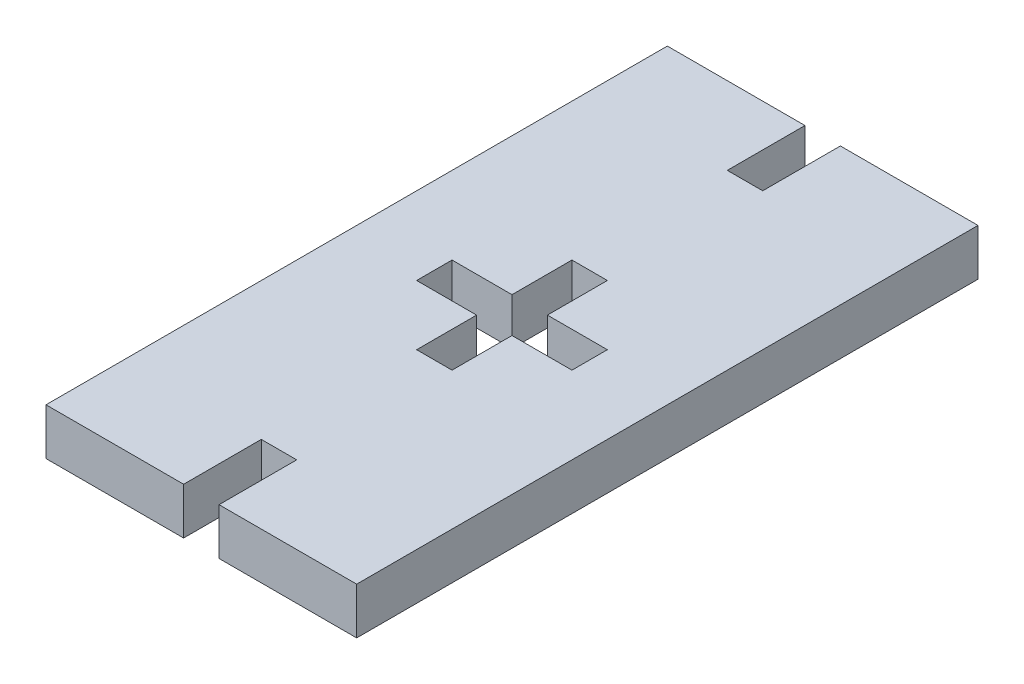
ISO-10303-21;
HEADER;
FILE_DESCRIPTION(('STEP AP214'),'2;1');
FILE_NAME('part.step','',(''),(''),'','','');
FILE_SCHEMA(('AUTOMOTIVE_DESIGN { 1 0 10303 214 1 1 1 1 }'));
ENDSEC;
DATA;
#1=APPLICATION_CONTEXT('core data for automotive mechanical design processes');
#2=APPLICATION_PROTOCOL_DEFINITION('international standard','automotive_design',2000,#1);
#3=PRODUCT_CONTEXT('',#1,'mechanical');
#4=PRODUCT('Part','Part','',(#3));
#5=PRODUCT_RELATED_PRODUCT_CATEGORY('part','',(#4));
#6=PRODUCT_DEFINITION_FORMATION('','',#4);
#7=PRODUCT_DEFINITION_CONTEXT('part definition',#1,'design');
#8=PRODUCT_DEFINITION('design','',#6,#7);
#9=PRODUCT_DEFINITION_SHAPE('','',#8);
#10=(LENGTH_UNIT() NAMED_UNIT(*) SI_UNIT(.MILLI.,.METRE.));
#11=(NAMED_UNIT(*) PLANE_ANGLE_UNIT() SI_UNIT($,.RADIAN.));
#12=(NAMED_UNIT(*) SI_UNIT($,.STERADIAN.) SOLID_ANGLE_UNIT());
#13=UNCERTAINTY_MEASURE_WITH_UNIT(LENGTH_MEASURE(1.E-05),#10,'distance_accuracy_value','');
#14=(GEOMETRIC_REPRESENTATION_CONTEXT(3) GLOBAL_UNCERTAINTY_ASSIGNED_CONTEXT((#13)) GLOBAL_UNIT_ASSIGNED_CONTEXT((#10,
#11,#12)) REPRESENTATION_CONTEXT('',''));
#15=CARTESIAN_POINT('',(0.,0.,0.));
#16=DIRECTION('',(0.,0.,1.));
#17=DIRECTION('',(1.,0.,0.));
#18=AXIS2_PLACEMENT_3D('',#15,#16,#17);
#19=CARTESIAN_POINT('',(-5.,-7.,1.14));
#20=DIRECTION('',(0.,0.,1.));
#21=DIRECTION('',(1.,0.,0.));
#22=AXIS2_PLACEMENT_3D('',#19,#20,#21);
#23=PLANE('',#22);
#24=DIRECTION('',(-1.,0.,0.));
#25=VECTOR('',#24,1.);
#26=CARTESIAN_POINT('',(0.,0.,1.14));
#27=LINE('',#26,#25);
#28=CARTESIAN_POINT('',(5.,0.,1.14));
#29=VERTEX_POINT('',#28);
#30=CARTESIAN_POINT('',(1.14,0.,1.14));
#31=VERTEX_POINT('',#30);
#32=EDGE_CURVE('E431',#29,#31,#27,.T.);
#33=ORIENTED_EDGE('',*,*,#32,.T.);
#34=DIRECTION('',(0.,1.,0.));
#35=VECTOR('',#34,1.);
#36=CARTESIAN_POINT('',(1.14,-7.,1.14));
#37=LINE('',#36,#35);
#38=CARTESIAN_POINT('',(1.14,3.,1.14));
#39=VERTEX_POINT('',#38);
#40=EDGE_CURVE('E262',#31,#39,#37,.T.);
#41=ORIENTED_EDGE('',*,*,#40,.T.);
#42=DIRECTION('',(1.,0.,0.));
#43=VECTOR('',#42,1.);
#44=CARTESIAN_POINT('',(-5.,3.,1.14));
#45=LINE('',#44,#43);
#46=CARTESIAN_POINT('',(5.,3.,1.14));
#47=VERTEX_POINT('',#46);
#48=EDGE_CURVE('E278',#39,#47,#45,.T.);
#49=ORIENTED_EDGE('',*,*,#48,.T.);
#50=DIRECTION('',(0.,1.,0.));
#51=VECTOR('',#50,1.);
#52=CARTESIAN_POINT('',(5.,-7.,1.14));
#53=LINE('',#52,#51);
#54=EDGE_CURVE('E284',#29,#47,#53,.T.);
#55=ORIENTED_EDGE('',*,*,#54,.F.);
#56=EDGE_LOOP('',(#33,#41,#49,#55));
#57=FACE_BOUND('',#56,.T.);
#58=ADVANCED_FACE('F43',(#57),#23,.F.);
#59=CARTESIAN_POINT('',(-5.,-7.,-1.14));
#60=DIRECTION('',(0.,0.,-1.));
#61=DIRECTION('',(-1.,0.,0.));
#62=AXIS2_PLACEMENT_3D('',#59,#60,#61);
#63=PLANE('',#62);
#64=DIRECTION('',(-1.,0.,0.));
#65=VECTOR('',#64,1.);
#66=CARTESIAN_POINT('',(-5.,3.,-1.14));
#67=LINE('',#66,#65);
#68=CARTESIAN_POINT('',(5.,3.,-1.14));
#69=VERTEX_POINT('',#68);
#70=CARTESIAN_POINT('',(1.14,3.,-1.14));
#71=VERTEX_POINT('',#70);
#72=EDGE_CURVE('E271',#69,#71,#67,.T.);
#73=ORIENTED_EDGE('',*,*,#72,.T.);
#74=DIRECTION('',(0.,-1.,0.));
#75=VECTOR('',#74,1.);
#76=CARTESIAN_POINT('',(1.14,-7.,-1.14));
#77=LINE('',#76,#75);
#78=CARTESIAN_POINT('',(1.14,0.,-1.14));
#79=VERTEX_POINT('',#78);
#80=EDGE_CURVE('E222',#71,#79,#77,.T.);
#81=ORIENTED_EDGE('',*,*,#80,.T.);
#82=DIRECTION('',(1.,0.,0.));
#83=VECTOR('',#82,1.);
#84=CARTESIAN_POINT('',(0.,0.,-1.14));
#85=LINE('',#84,#83);
#86=CARTESIAN_POINT('',(5.,0.,-1.14));
#87=VERTEX_POINT('',#86);
#88=EDGE_CURVE('E421',#79,#87,#85,.T.);
#89=ORIENTED_EDGE('',*,*,#88,.T.);
#90=DIRECTION('',(0.,1.,0.));
#91=VECTOR('',#90,1.);
#92=CARTESIAN_POINT('',(5.,-7.,-1.14));
#93=LINE('',#92,#91);
#94=EDGE_CURVE('E283',#87,#69,#93,.T.);
#95=ORIENTED_EDGE('',*,*,#94,.T.);
#96=EDGE_LOOP('',(#73,#81,#89,#95));
#97=FACE_BOUND('',#96,.T.);
#98=ADVANCED_FACE('F490',(#97),#63,.F.);
#99=CARTESIAN_POINT('',(-10.,3.,-20.));
#100=DIRECTION('',(0.,0.,1.));
#101=DIRECTION('',(1.,0.,0.));
#102=AXIS2_PLACEMENT_3D('',#99,#100,#101);
#103=PLANE('',#102);
#104=DIRECTION('',(0.,-1.,0.));
#105=VECTOR('',#104,1.);
#106=CARTESIAN_POINT('',(1.14,3.,-20.));
#107=LINE('',#106,#105);
#108=CARTESIAN_POINT('',(1.14,3.,-20.));
#109=VERTEX_POINT('',#108);
#110=CARTESIAN_POINT('',(1.14,0.,-20.));
#111=VERTEX_POINT('',#110);
#112=EDGE_CURVE('E354',#109,#111,#107,.T.);
#113=ORIENTED_EDGE('',*,*,#112,.F.);
#114=DIRECTION('',(-1.,0.,0.));
#115=VECTOR('',#114,1.);
#116=CARTESIAN_POINT('',(-10.,3.,-20.));
#117=LINE('',#116,#115);
#118=CARTESIAN_POINT('',(10.,3.,-20.));
#119=VERTEX_POINT('',#118);
#120=EDGE_CURVE('E364',#119,#109,#117,.T.);
#121=ORIENTED_EDGE('',*,*,#120,.F.);
#122=DIRECTION('',(0.,-1.,0.));
#123=VECTOR('',#122,1.);
#124=CARTESIAN_POINT('',(10.,3.,-20.));
#125=LINE('',#124,#123);
#126=CARTESIAN_POINT('',(10.,0.,-20.));
#127=VERTEX_POINT('',#126);
#128=EDGE_CURVE('E403',#119,#127,#125,.T.);
#129=ORIENTED_EDGE('',*,*,#128,.T.);
#130=DIRECTION('',(-1.,0.,0.));
#131=VECTOR('',#130,1.);
#132=CARTESIAN_POINT('',(-10.,0.,-20.));
#133=LINE('',#132,#131);
#134=EDGE_CURVE('E381',#127,#111,#133,.T.);
#135=ORIENTED_EDGE('',*,*,#134,.T.);
#136=EDGE_LOOP('',(#113,#121,#129,#135));
#137=FACE_BOUND('',#136,.T.);
#138=ADVANCED_FACE('F496',(#137),#103,.F.);
#139=CARTESIAN_POINT('',(-10.,3.,20.));
#140=DIRECTION('',(0.,0.,-1.));
#141=DIRECTION('',(-1.,0.,0.));
#142=AXIS2_PLACEMENT_3D('',#139,#140,#141);
#143=PLANE('',#142);
#144=DIRECTION('',(0.,-1.,0.));
#145=VECTOR('',#144,1.);
#146=CARTESIAN_POINT('',(-1.14,3.,20.));
#147=LINE('',#146,#145);
#148=CARTESIAN_POINT('',(-1.14,3.,20.));
#149=VERTEX_POINT('',#148);
#150=CARTESIAN_POINT('',(-1.14,0.,20.));
#151=VERTEX_POINT('',#150);
#152=EDGE_CURVE('E347',#149,#151,#147,.T.);
#153=ORIENTED_EDGE('',*,*,#152,.F.);
#154=DIRECTION('',(1.,0.,0.));
#155=VECTOR('',#154,1.);
#156=CARTESIAN_POINT('',(-10.,3.,20.));
#157=LINE('',#156,#155);
#158=CARTESIAN_POINT('',(-10.,3.,20.));
#159=VERTEX_POINT('',#158);
#160=EDGE_CURVE('E372',#159,#149,#157,.T.);
#161=ORIENTED_EDGE('',*,*,#160,.F.);
#162=DIRECTION('',(0.,-1.,0.));
#163=VECTOR('',#162,1.);
#164=CARTESIAN_POINT('',(-10.,3.,20.));
#165=LINE('',#164,#163);
#166=CARTESIAN_POINT('',(-10.,0.,20.));
#167=VERTEX_POINT('',#166);
#168=EDGE_CURVE('E395',#159,#167,#165,.T.);
#169=ORIENTED_EDGE('',*,*,#168,.T.);
#170=DIRECTION('',(1.,0.,0.));
#171=VECTOR('',#170,1.);
#172=CARTESIAN_POINT('',(-10.,0.,20.));
#173=LINE('',#172,#171);
#174=EDGE_CURVE('E363',#167,#151,#173,.T.);
#175=ORIENTED_EDGE('',*,*,#174,.T.);
#176=EDGE_LOOP('',(#153,#161,#169,#175));
#177=FACE_BOUND('',#176,.T.);
#178=ADVANCED_FACE('F539',(#177),#143,.F.);
#179=CARTESIAN_POINT('',(0.,3.,0.));
#180=DIRECTION('',(0.,-1.,0.));
#181=DIRECTION('',(0.,0.,-1.));
#182=AXIS2_PLACEMENT_3D('',#179,#180,#181);
#183=PLANE('',#182);
#184=ORIENTED_EDGE('',*,*,#48,.F.);
#185=DIRECTION('',(0.,0.,-1.));
#186=VECTOR('',#185,1.);
#187=CARTESIAN_POINT('',(1.14,3.,-5.));
#188=LINE('',#187,#186);
#189=CARTESIAN_POINT('',(1.14,3.,5.));
#190=VERTEX_POINT('',#189);
#191=EDGE_CURVE('E227',#190,#39,#188,.T.);
#192=ORIENTED_EDGE('',*,*,#191,.F.);
#193=DIRECTION('',(1.,0.,0.));
#194=VECTOR('',#193,1.);
#195=CARTESIAN_POINT('',(-1.14,3.,5.));
#196=LINE('',#195,#194);
#197=CARTESIAN_POINT('',(-1.14,3.,5.));
#198=VERTEX_POINT('',#197);
#199=EDGE_CURVE('E216',#198,#190,#196,.T.);
#200=ORIENTED_EDGE('',*,*,#199,.F.);
#201=DIRECTION('',(0.,0.,1.));
#202=VECTOR('',#201,1.);
#203=CARTESIAN_POINT('',(-1.14,3.,-5.));
#204=LINE('',#203,#202);
#205=CARTESIAN_POINT('',(-1.14,3.,1.14));
#206=VERTEX_POINT('',#205);
#207=EDGE_CURVE('E234',#206,#198,#204,.T.);
#208=ORIENTED_EDGE('',*,*,#207,.F.);
#209=CARTESIAN_POINT('',(-5.,3.,1.14));
#210=VERTEX_POINT('',#209);
#211=EDGE_CURVE('E279',#210,#206,#45,.T.);
#212=ORIENTED_EDGE('',*,*,#211,.F.);
#213=DIRECTION('',(0.,0.,1.));
#214=VECTOR('',#213,1.);
#215=CARTESIAN_POINT('',(-5.,3.,1.14));
#216=LINE('',#215,#214);
#217=CARTESIAN_POINT('',(-5.,3.,-1.14));
#218=VERTEX_POINT('',#217);
#219=EDGE_CURVE('E274',#218,#210,#216,.T.);
#220=ORIENTED_EDGE('',*,*,#219,.F.);
#221=CARTESIAN_POINT('',(-1.14,3.,-1.14));
#222=VERTEX_POINT('',#221);
#223=EDGE_CURVE('E270',#222,#218,#67,.T.);
#224=ORIENTED_EDGE('',*,*,#223,.F.);
#225=CARTESIAN_POINT('',(-1.14,3.,-5.));
#226=VERTEX_POINT('',#225);
#227=EDGE_CURVE('E67',#226,#222,#204,.T.);
#228=ORIENTED_EDGE('',*,*,#227,.F.);
#229=DIRECTION('',(-1.,0.,0.));
#230=VECTOR('',#229,1.);
#231=CARTESIAN_POINT('',(-1.14,3.,-5.));
#232=LINE('',#231,#230);
#233=CARTESIAN_POINT('',(1.14,3.,-5.));
#234=VERTEX_POINT('',#233);
#235=EDGE_CURVE('E210',#234,#226,#232,.T.);
#236=ORIENTED_EDGE('',*,*,#235,.F.);
#237=EDGE_CURVE('E219',#71,#234,#188,.T.);
#238=ORIENTED_EDGE('',*,*,#237,.F.);
#239=ORIENTED_EDGE('',*,*,#72,.F.);
#240=DIRECTION('',(0.,0.,-1.));
#241=VECTOR('',#240,1.);
#242=CARTESIAN_POINT('',(5.,3.,1.14));
#243=LINE('',#242,#241);
#244=EDGE_CURVE('E267',#47,#69,#243,.T.);
#245=ORIENTED_EDGE('',*,*,#244,.F.);
#246=EDGE_LOOP('',(#184,#192,#200,#208,#212,#220,#224,#228,#236,#238,#239,#245));
#247=FACE_BOUND('',#246,.T.);
#248=DIRECTION('',(0.,0.,1.));
#249=VECTOR('',#248,1.);
#250=CARTESIAN_POINT('',(1.14,3.,-25.));
#251=LINE('',#250,#249);
#252=CARTESIAN_POINT('',(1.14,3.,-15.));
#253=VERTEX_POINT('',#252);
#254=EDGE_CURVE('E305',#109,#253,#251,.T.);
#255=ORIENTED_EDGE('',*,*,#254,.T.);
#256=DIRECTION('',(1.,0.,0.));
#257=VECTOR('',#256,1.);
#258=CARTESIAN_POINT('',(-1.14,3.,-15.));
#259=LINE('',#258,#257);
#260=CARTESIAN_POINT('',(-1.14,3.,-15.));
#261=VERTEX_POINT('',#260);
#262=EDGE_CURVE('E309',#261,#253,#259,.T.);
#263=ORIENTED_EDGE('',*,*,#262,.F.);
#264=DIRECTION('',(0.,0.,1.));
#265=VECTOR('',#264,1.);
#266=CARTESIAN_POINT('',(-1.14,3.,-25.));
#267=LINE('',#266,#265);
#268=CARTESIAN_POINT('',(-1.14,3.,-20.));
#269=VERTEX_POINT('',#268);
#270=EDGE_CURVE('E304',#269,#261,#267,.T.);
#271=ORIENTED_EDGE('',*,*,#270,.F.);
#272=CARTESIAN_POINT('',(-10.,3.,-20.));
#273=VERTEX_POINT('',#272);
#274=EDGE_CURVE('E362',#269,#273,#117,.T.);
#275=ORIENTED_EDGE('',*,*,#274,.T.);
#276=DIRECTION('',(0.,0.,1.));
#277=VECTOR('',#276,1.);
#278=CARTESIAN_POINT('',(-10.,3.,20.));
#279=LINE('',#278,#277);
#280=EDGE_CURVE('E368',#273,#159,#279,.T.);
#281=ORIENTED_EDGE('',*,*,#280,.T.);
#282=ORIENTED_EDGE('',*,*,#160,.T.);
#283=DIRECTION('',(0.,0.,-1.));
#284=VECTOR('',#283,1.);
#285=CARTESIAN_POINT('',(-1.13999999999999,3.,25.));
#286=LINE('',#285,#284);
#287=CARTESIAN_POINT('',(-1.14,3.,15.));
#288=VERTEX_POINT('',#287);
#289=EDGE_CURVE('E310',#149,#288,#286,.T.);
#290=ORIENTED_EDGE('',*,*,#289,.T.);
#291=DIRECTION('',(1.,0.,0.));
#292=VECTOR('',#291,1.);
#293=CARTESIAN_POINT('',(-1.14,3.,15.));
#294=LINE('',#293,#292);
#295=CARTESIAN_POINT('',(1.14,3.,15.));
#296=VERTEX_POINT('',#295);
#297=EDGE_CURVE('E334',#288,#296,#294,.T.);
#298=ORIENTED_EDGE('',*,*,#297,.T.);
#299=DIRECTION('',(0.,0.,-1.));
#300=VECTOR('',#299,1.);
#301=CARTESIAN_POINT('',(1.14000000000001,3.,25.));
#302=LINE('',#301,#300);
#303=CARTESIAN_POINT('',(1.14,3.,20.));
#304=VERTEX_POINT('',#303);
#305=EDGE_CURVE('E331',#304,#296,#302,.T.);
#306=ORIENTED_EDGE('',*,*,#305,.F.);
#307=CARTESIAN_POINT('',(10.,3.,20.));
#308=VERTEX_POINT('',#307);
#309=EDGE_CURVE('E371',#304,#308,#157,.T.);
#310=ORIENTED_EDGE('',*,*,#309,.T.);
#311=DIRECTION('',(0.,0.,-1.));
#312=VECTOR('',#311,1.);
#313=CARTESIAN_POINT('',(10.,3.,20.));
#314=LINE('',#313,#312);
#315=EDGE_CURVE('E358',#308,#119,#314,.T.);
#316=ORIENTED_EDGE('',*,*,#315,.T.);
#317=ORIENTED_EDGE('',*,*,#120,.T.);
#318=EDGE_LOOP('',(#255,#263,#271,#275,#281,#282,#290,#298,#306,#310,#316,#317));
#319=FACE_BOUND('',#318,.T.);
#320=ADVANCED_FACE('F230',(#247,#319),#183,.F.);
#321=CARTESIAN_POINT('',(0.,0.,0.));
#322=DIRECTION('',(0.,-1.,0.));
#323=DIRECTION('',(0.,0.,-1.));
#324=AXIS2_PLACEMENT_3D('',#321,#322,#323);
#325=PLANE('',#324);
#326=DIRECTION('',(0.,0.,1.));
#327=VECTOR('',#326,1.);
#328=CARTESIAN_POINT('',(1.14,0.,0.));
#329=LINE('',#328,#327);
#330=CARTESIAN_POINT('',(1.14,0.,5.));
#331=VERTEX_POINT('',#330);
#332=EDGE_CURVE('E263',#31,#331,#329,.T.);
#333=ORIENTED_EDGE('',*,*,#332,.F.);
#334=ORIENTED_EDGE('',*,*,#32,.F.);
#335=DIRECTION('',(0.,0.,1.));
#336=VECTOR('',#335,1.);
#337=CARTESIAN_POINT('',(5.,0.,0.));
#338=LINE('',#337,#336);
#339=EDGE_CURVE('E435',#87,#29,#338,.T.);
#340=ORIENTED_EDGE('',*,*,#339,.F.);
#341=ORIENTED_EDGE('',*,*,#88,.F.);
#342=CARTESIAN_POINT('',(1.14,0.,-5.));
#343=VERTEX_POINT('',#342);
#344=EDGE_CURVE('E259',#343,#79,#329,.T.);
#345=ORIENTED_EDGE('',*,*,#344,.F.);
#346=DIRECTION('',(1.,0.,0.));
#347=VECTOR('',#346,1.);
#348=CARTESIAN_POINT('',(0.,0.,-5.));
#349=LINE('',#348,#347);
#350=CARTESIAN_POINT('',(-1.14,0.,-5.));
#351=VERTEX_POINT('',#350);
#352=EDGE_CURVE('E52',#351,#343,#349,.T.);
#353=ORIENTED_EDGE('',*,*,#352,.F.);
#354=DIRECTION('',(0.,0.,-1.));
#355=VECTOR('',#354,1.);
#356=CARTESIAN_POINT('',(-1.14,0.,0.));
#357=LINE('',#356,#355);
#358=CARTESIAN_POINT('',(-1.14,0.,-1.14));
#359=VERTEX_POINT('',#358);
#360=EDGE_CURVE('E248',#359,#351,#357,.T.);
#361=ORIENTED_EDGE('',*,*,#360,.F.);
#362=CARTESIAN_POINT('',(-5.,0.,-1.14));
#363=VERTEX_POINT('',#362);
#364=EDGE_CURVE('E422',#363,#359,#85,.T.);
#365=ORIENTED_EDGE('',*,*,#364,.F.);
#366=DIRECTION('',(0.,0.,-1.));
#367=VECTOR('',#366,1.);
#368=CARTESIAN_POINT('',(-5.,0.,0.));
#369=LINE('',#368,#367);
#370=CARTESIAN_POINT('',(-5.,0.,1.14));
#371=VERTEX_POINT('',#370);
#372=EDGE_CURVE('E426',#371,#363,#369,.T.);
#373=ORIENTED_EDGE('',*,*,#372,.F.);
#374=CARTESIAN_POINT('',(-1.14,0.,1.14));
#375=VERTEX_POINT('',#374);
#376=EDGE_CURVE('E430',#375,#371,#27,.T.);
#377=ORIENTED_EDGE('',*,*,#376,.F.);
#378=CARTESIAN_POINT('',(-1.14,0.,5.));
#379=VERTEX_POINT('',#378);
#380=EDGE_CURVE('E59',#379,#375,#357,.T.);
#381=ORIENTED_EDGE('',*,*,#380,.F.);
#382=DIRECTION('',(-1.,0.,0.));
#383=VECTOR('',#382,1.);
#384=CARTESIAN_POINT('',(0.,0.,5.));
#385=LINE('',#384,#383);
#386=EDGE_CURVE('E11',#331,#379,#385,.T.);
#387=ORIENTED_EDGE('',*,*,#386,.F.);
#388=EDGE_LOOP('',(#333,#334,#340,#341,#345,#353,#361,#365,#373,#377,#381,#387));
#389=FACE_BOUND('',#388,.T.);
#390=DIRECTION('',(1.,0.,0.));
#391=VECTOR('',#390,1.);
#392=CARTESIAN_POINT('',(-1.14,0.,-15.));
#393=LINE('',#392,#391);
#394=CARTESIAN_POINT('',(-1.14,0.,-15.));
#395=VERTEX_POINT('',#394);
#396=CARTESIAN_POINT('',(1.14,0.,-15.));
#397=VERTEX_POINT('',#396);
#398=EDGE_CURVE('E299',#395,#397,#393,.T.);
#399=ORIENTED_EDGE('',*,*,#398,.T.);
#400=DIRECTION('',(0.,0.,-1.));
#401=VECTOR('',#400,1.);
#402=CARTESIAN_POINT('',(1.14,0.,0.));
#403=LINE('',#402,#401);
#404=EDGE_CURVE('E417',#397,#111,#403,.T.);
#405=ORIENTED_EDGE('',*,*,#404,.T.);
#406=ORIENTED_EDGE('',*,*,#134,.F.);
#407=DIRECTION('',(0.,0.,-1.));
#408=VECTOR('',#407,1.);
#409=CARTESIAN_POINT('',(10.,0.,20.));
#410=LINE('',#409,#408);
#411=CARTESIAN_POINT('',(10.,0.,20.));
#412=VERTEX_POINT('',#411);
#413=EDGE_CURVE('E357',#412,#127,#410,.T.);
#414=ORIENTED_EDGE('',*,*,#413,.F.);
#415=CARTESIAN_POINT('',(1.14,0.,20.));
#416=VERTEX_POINT('',#415);
#417=EDGE_CURVE('E388',#416,#412,#173,.T.);
#418=ORIENTED_EDGE('',*,*,#417,.F.);
#419=DIRECTION('',(0.,0.,1.));
#420=VECTOR('',#419,1.);
#421=CARTESIAN_POINT('',(1.14,0.,0.));
#422=LINE('',#421,#420);
#423=CARTESIAN_POINT('',(1.14,0.,15.));
#424=VERTEX_POINT('',#423);
#425=EDGE_CURVE('E407',#424,#416,#422,.T.);
#426=ORIENTED_EDGE('',*,*,#425,.F.);
#427=DIRECTION('',(1.,0.,0.));
#428=VECTOR('',#427,1.);
#429=CARTESIAN_POINT('',(-1.14,0.,15.));
#430=LINE('',#429,#428);
#431=CARTESIAN_POINT('',(-1.14,0.,15.));
#432=VERTEX_POINT('',#431);
#433=EDGE_CURVE('E330',#432,#424,#430,.T.);
#434=ORIENTED_EDGE('',*,*,#433,.F.);
#435=DIRECTION('',(0.,0.,1.));
#436=VECTOR('',#435,1.);
#437=CARTESIAN_POINT('',(-1.14,0.,0.));
#438=LINE('',#437,#436);
#439=EDGE_CURVE('E410',#432,#151,#438,.T.);
#440=ORIENTED_EDGE('',*,*,#439,.T.);
#441=ORIENTED_EDGE('',*,*,#174,.F.);
#442=DIRECTION('',(0.,0.,1.));
#443=VECTOR('',#442,1.);
#444=CARTESIAN_POINT('',(-10.,0.,20.));
#445=LINE('',#444,#443);
#446=CARTESIAN_POINT('',(-10.,0.,-20.));
#447=VERTEX_POINT('',#446);
#448=EDGE_CURVE('E385',#447,#167,#445,.T.);
#449=ORIENTED_EDGE('',*,*,#448,.F.);
#450=CARTESIAN_POINT('',(-1.14,0.,-20.));
#451=VERTEX_POINT('',#450);
#452=EDGE_CURVE('E380',#451,#447,#133,.T.);
#453=ORIENTED_EDGE('',*,*,#452,.F.);
#454=DIRECTION('',(0.,0.,-1.));
#455=VECTOR('',#454,1.);
#456=CARTESIAN_POINT('',(-1.14,0.,0.));
#457=LINE('',#456,#455);
#458=EDGE_CURVE('E414',#395,#451,#457,.T.);
#459=ORIENTED_EDGE('',*,*,#458,.F.);
#460=EDGE_LOOP('',(#399,#405,#406,#414,#418,#426,#434,#440,#441,#449,#453,#459));
#461=FACE_BOUND('',#460,.T.);
#462=ADVANCED_FACE('F464',(#389,#461),#325,.T.);
#463=CARTESIAN_POINT('',(10.,3.,20.));
#464=DIRECTION('',(-1.,0.,0.));
#465=DIRECTION('',(0.,0.,1.));
#466=AXIS2_PLACEMENT_3D('',#463,#464,#465);
#467=PLANE('',#466);
#468=ORIENTED_EDGE('',*,*,#413,.T.);
#469=ORIENTED_EDGE('',*,*,#128,.F.);
#470=ORIENTED_EDGE('',*,*,#315,.F.);
#471=DIRECTION('',(0.,-1.,0.));
#472=VECTOR('',#471,1.);
#473=CARTESIAN_POINT('',(10.,3.,20.));
#474=LINE('',#473,#472);
#475=EDGE_CURVE('E376',#308,#412,#474,.T.);
#476=ORIENTED_EDGE('',*,*,#475,.T.);
#477=EDGE_LOOP('',(#468,#469,#470,#476));
#478=FACE_BOUND('',#477,.T.);
#479=ADVANCED_FACE('F45',(#478),#467,.F.);
#480=ORIENTED_EDGE('',*,*,#274,.F.);
#481=DIRECTION('',(0.,-1.,0.));
#482=VECTOR('',#481,1.);
#483=CARTESIAN_POINT('',(-1.14,3.,-20.));
#484=LINE('',#483,#482);
#485=EDGE_CURVE('E350',#269,#451,#484,.T.);
#486=ORIENTED_EDGE('',*,*,#485,.T.);
#487=ORIENTED_EDGE('',*,*,#452,.T.);
#488=DIRECTION('',(0.,-1.,0.));
#489=VECTOR('',#488,1.);
#490=CARTESIAN_POINT('',(-10.,3.,-20.));
#491=LINE('',#490,#489);
#492=EDGE_CURVE('E399',#273,#447,#491,.T.);
#493=ORIENTED_EDGE('',*,*,#492,.F.);
#494=EDGE_LOOP('',(#480,#486,#487,#493));
#495=FACE_BOUND('',#494,.T.);
#496=ADVANCED_FACE('F547',(#495),#103,.F.);
#497=CARTESIAN_POINT('',(-10.,3.,20.));
#498=DIRECTION('',(1.,0.,0.));
#499=DIRECTION('',(0.,0.,-1.));
#500=AXIS2_PLACEMENT_3D('',#497,#498,#499);
#501=PLANE('',#500);
#502=ORIENTED_EDGE('',*,*,#448,.T.);
#503=ORIENTED_EDGE('',*,*,#168,.F.);
#504=ORIENTED_EDGE('',*,*,#280,.F.);
#505=ORIENTED_EDGE('',*,*,#492,.T.);
#506=EDGE_LOOP('',(#502,#503,#504,#505));
#507=FACE_BOUND('',#506,.T.);
#508=ADVANCED_FACE('F544',(#507),#501,.F.);
#509=ORIENTED_EDGE('',*,*,#309,.F.);
#510=DIRECTION('',(0.,-1.,0.));
#511=VECTOR('',#510,1.);
#512=CARTESIAN_POINT('',(1.14000000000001,3.,20.));
#513=LINE('',#512,#511);
#514=EDGE_CURVE('E322',#304,#416,#513,.T.);
#515=ORIENTED_EDGE('',*,*,#514,.T.);
#516=ORIENTED_EDGE('',*,*,#417,.T.);
#517=ORIENTED_EDGE('',*,*,#475,.F.);
#518=EDGE_LOOP('',(#509,#515,#516,#517));
#519=FACE_BOUND('',#518,.T.);
#520=ADVANCED_FACE('F529',(#519),#143,.F.);
#521=CARTESIAN_POINT('',(-1.13999999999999,0.,25.));
#522=DIRECTION('',(1.,0.,0.));
#523=DIRECTION('',(0.,0.,-1.));
#524=AXIS2_PLACEMENT_3D('',#521,#522,#523);
#525=PLANE('',#524);
#526=ORIENTED_EDGE('',*,*,#152,.T.);
#527=ORIENTED_EDGE('',*,*,#439,.F.);
#528=DIRECTION('',(0.,1.,0.));
#529=VECTOR('',#528,1.);
#530=CARTESIAN_POINT('',(-1.14,0.,15.));
#531=LINE('',#530,#529);
#532=EDGE_CURVE('E288',#432,#288,#531,.T.);
#533=ORIENTED_EDGE('',*,*,#532,.T.);
#534=ORIENTED_EDGE('',*,*,#289,.F.);
#535=EDGE_LOOP('',(#526,#527,#533,#534));
#536=FACE_BOUND('',#535,.T.);
#537=ADVANCED_FACE('F525',(#536),#525,.T.);
#538=CARTESIAN_POINT('',(1.14000000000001,0.,25.));
#539=DIRECTION('',(1.,0.,0.));
#540=DIRECTION('',(0.,0.,-1.));
#541=AXIS2_PLACEMENT_3D('',#538,#539,#540);
#542=PLANE('',#541);
#543=ORIENTED_EDGE('',*,*,#305,.T.);
#544=DIRECTION('',(0.,1.,0.));
#545=VECTOR('',#544,1.);
#546=CARTESIAN_POINT('',(1.14,0.,15.));
#547=LINE('',#546,#545);
#548=EDGE_CURVE('E326',#424,#296,#547,.T.);
#549=ORIENTED_EDGE('',*,*,#548,.F.);
#550=ORIENTED_EDGE('',*,*,#425,.T.);
#551=ORIENTED_EDGE('',*,*,#514,.F.);
#552=EDGE_LOOP('',(#543,#549,#550,#551));
#553=FACE_BOUND('',#552,.T.);
#554=ADVANCED_FACE('F528',(#553),#542,.F.);
#555=CARTESIAN_POINT('',(-1.14,0.,15.));
#556=DIRECTION('',(0.,0.,1.));
#557=DIRECTION('',(1.,0.,0.));
#558=AXIS2_PLACEMENT_3D('',#555,#556,#557);
#559=PLANE('',#558);
#560=ORIENTED_EDGE('',*,*,#297,.F.);
#561=ORIENTED_EDGE('',*,*,#532,.F.);
#562=ORIENTED_EDGE('',*,*,#433,.T.);
#563=ORIENTED_EDGE('',*,*,#548,.T.);
#564=EDGE_LOOP('',(#560,#561,#562,#563));
#565=FACE_BOUND('',#564,.T.);
#566=ADVANCED_FACE('F523',(#565),#559,.T.);
#567=CARTESIAN_POINT('',(1.14,0.,-25.));
#568=DIRECTION('',(-1.,0.,0.));
#569=DIRECTION('',(0.,0.,1.));
#570=AXIS2_PLACEMENT_3D('',#567,#568,#569);
#571=PLANE('',#570);
#572=ORIENTED_EDGE('',*,*,#112,.T.);
#573=ORIENTED_EDGE('',*,*,#404,.F.);
#574=DIRECTION('',(0.,1.,0.));
#575=VECTOR('',#574,1.);
#576=CARTESIAN_POINT('',(1.14,0.,-15.));
#577=LINE('',#576,#575);
#578=EDGE_CURVE('E319',#397,#253,#577,.T.);
#579=ORIENTED_EDGE('',*,*,#578,.T.);
#580=ORIENTED_EDGE('',*,*,#254,.F.);
#581=EDGE_LOOP('',(#572,#573,#579,#580));
#582=FACE_BOUND('',#581,.T.);
#583=ADVANCED_FACE('F518',(#582),#571,.T.);
#584=CARTESIAN_POINT('',(-1.14,0.,-25.));
#585=DIRECTION('',(-1.,0.,0.));
#586=DIRECTION('',(0.,0.,1.));
#587=AXIS2_PLACEMENT_3D('',#584,#585,#586);
#588=PLANE('',#587);
#589=ORIENTED_EDGE('',*,*,#270,.T.);
#590=DIRECTION('',(0.,1.,0.));
#591=VECTOR('',#590,1.);
#592=CARTESIAN_POINT('',(-1.14,0.,-15.));
#593=LINE('',#592,#591);
#594=EDGE_CURVE('E303',#395,#261,#593,.T.);
#595=ORIENTED_EDGE('',*,*,#594,.F.);
#596=ORIENTED_EDGE('',*,*,#458,.T.);
#597=ORIENTED_EDGE('',*,*,#485,.F.);
#598=EDGE_LOOP('',(#589,#595,#596,#597));
#599=FACE_BOUND('',#598,.T.);
#600=ADVANCED_FACE('F513',(#599),#588,.F.);
#601=CARTESIAN_POINT('',(-1.14,0.,-15.));
#602=DIRECTION('',(0.,0.,1.));
#603=DIRECTION('',(1.,0.,0.));
#604=AXIS2_PLACEMENT_3D('',#601,#602,#603);
#605=PLANE('',#604);
#606=ORIENTED_EDGE('',*,*,#262,.T.);
#607=ORIENTED_EDGE('',*,*,#578,.F.);
#608=ORIENTED_EDGE('',*,*,#398,.F.);
#609=ORIENTED_EDGE('',*,*,#594,.T.);
#610=EDGE_LOOP('',(#606,#607,#608,#609));
#611=FACE_BOUND('',#610,.T.);
#612=ADVANCED_FACE('F507',(#611),#605,.F.);
#613=CARTESIAN_POINT('',(5.,-7.,1.14));
#614=DIRECTION('',(1.,0.,0.));
#615=DIRECTION('',(0.,0.,-1.));
#616=AXIS2_PLACEMENT_3D('',#613,#614,#615);
#617=PLANE('',#616);
#618=ORIENTED_EDGE('',*,*,#339,.T.);
#619=ORIENTED_EDGE('',*,*,#54,.T.);
#620=ORIENTED_EDGE('',*,*,#244,.T.);
#621=ORIENTED_EDGE('',*,*,#94,.F.);
#622=EDGE_LOOP('',(#618,#619,#620,#621));
#623=FACE_BOUND('',#622,.T.);
#624=ADVANCED_FACE('F502',(#623),#617,.F.);
#625=ORIENTED_EDGE('',*,*,#211,.T.);
#626=DIRECTION('',(0.,-1.,0.));
#627=VECTOR('',#626,1.);
#628=CARTESIAN_POINT('',(-1.14,-7.,1.14));
#629=LINE('',#628,#627);
#630=EDGE_CURVE('E256',#206,#375,#629,.T.);
#631=ORIENTED_EDGE('',*,*,#630,.T.);
#632=ORIENTED_EDGE('',*,*,#376,.T.);
#633=DIRECTION('',(0.,1.,0.));
#634=VECTOR('',#633,1.);
#635=CARTESIAN_POINT('',(-5.,-7.,1.14));
#636=LINE('',#635,#634);
#637=EDGE_CURVE('E289',#371,#210,#636,.T.);
#638=ORIENTED_EDGE('',*,*,#637,.T.);
#639=EDGE_LOOP('',(#625,#631,#632,#638));
#640=FACE_BOUND('',#639,.T.);
#641=ADVANCED_FACE('F471',(#640),#23,.F.);
#642=CARTESIAN_POINT('',(-5.,-7.,1.14));
#643=DIRECTION('',(-1.,0.,0.));
#644=DIRECTION('',(0.,0.,1.));
#645=AXIS2_PLACEMENT_3D('',#642,#643,#644);
#646=PLANE('',#645);
#647=ORIENTED_EDGE('',*,*,#372,.T.);
#648=DIRECTION('',(0.,1.,0.));
#649=VECTOR('',#648,1.);
#650=CARTESIAN_POINT('',(-5.,-7.,-1.14));
#651=LINE('',#650,#649);
#652=EDGE_CURVE('E292',#363,#218,#651,.T.);
#653=ORIENTED_EDGE('',*,*,#652,.T.);
#654=ORIENTED_EDGE('',*,*,#219,.T.);
#655=ORIENTED_EDGE('',*,*,#637,.F.);
#656=EDGE_LOOP('',(#647,#653,#654,#655));
#657=FACE_BOUND('',#656,.T.);
#658=ADVANCED_FACE('F473',(#657),#646,.F.);
#659=ORIENTED_EDGE('',*,*,#364,.T.);
#660=DIRECTION('',(0.,1.,0.));
#661=VECTOR('',#660,1.);
#662=CARTESIAN_POINT('',(-1.14,-7.,-1.14));
#663=LINE('',#662,#661);
#664=EDGE_CURVE('E438',#359,#222,#663,.T.);
#665=ORIENTED_EDGE('',*,*,#664,.T.);
#666=ORIENTED_EDGE('',*,*,#223,.T.);
#667=ORIENTED_EDGE('',*,*,#652,.F.);
#668=EDGE_LOOP('',(#659,#665,#666,#667));
#669=FACE_BOUND('',#668,.T.);
#670=ADVANCED_FACE('F499',(#669),#63,.F.);
#671=CARTESIAN_POINT('',(1.14,-7.,-5.));
#672=DIRECTION('',(1.,0.,0.));
#673=DIRECTION('',(0.,0.,-1.));
#674=AXIS2_PLACEMENT_3D('',#671,#672,#673);
#675=PLANE('',#674);
#676=ORIENTED_EDGE('',*,*,#344,.T.);
#677=ORIENTED_EDGE('',*,*,#80,.F.);
#678=ORIENTED_EDGE('',*,*,#237,.T.);
#679=DIRECTION('',(0.,1.,0.));
#680=VECTOR('',#679,1.);
#681=CARTESIAN_POINT('',(1.14,-7.,-5.));
#682=LINE('',#681,#680);
#683=EDGE_CURVE('E205',#343,#234,#682,.T.);
#684=ORIENTED_EDGE('',*,*,#683,.F.);
#685=EDGE_LOOP('',(#676,#677,#678,#684));
#686=FACE_BOUND('',#685,.T.);
#687=ADVANCED_FACE('F220',(#686),#675,.F.);
#688=CARTESIAN_POINT('',(-1.14,-7.,-5.));
#689=DIRECTION('',(-1.,0.,0.));
#690=DIRECTION('',(0.,0.,1.));
#691=AXIS2_PLACEMENT_3D('',#688,#689,#690);
#692=PLANE('',#691);
#693=ORIENTED_EDGE('',*,*,#360,.T.);
#694=DIRECTION('',(0.,1.,0.));
#695=VECTOR('',#694,1.);
#696=CARTESIAN_POINT('',(-1.14,-7.,-5.));
#697=LINE('',#696,#695);
#698=EDGE_CURVE('E215',#351,#226,#697,.T.);
#699=ORIENTED_EDGE('',*,*,#698,.T.);
#700=ORIENTED_EDGE('',*,*,#227,.T.);
#701=ORIENTED_EDGE('',*,*,#664,.F.);
#702=EDGE_LOOP('',(#693,#699,#700,#701));
#703=FACE_BOUND('',#702,.T.);
#704=ADVANCED_FACE('F480',(#703),#692,.F.);
#705=CARTESIAN_POINT('',(-1.14,-7.,-5.));
#706=DIRECTION('',(0.,0.,-1.));
#707=DIRECTION('',(-1.,0.,0.));
#708=AXIS2_PLACEMENT_3D('',#705,#706,#707);
#709=PLANE('',#708);
#710=ORIENTED_EDGE('',*,*,#352,.T.);
#711=ORIENTED_EDGE('',*,*,#683,.T.);
#712=ORIENTED_EDGE('',*,*,#235,.T.);
#713=ORIENTED_EDGE('',*,*,#698,.F.);
#714=EDGE_LOOP('',(#710,#711,#712,#713));
#715=FACE_BOUND('',#714,.T.);
#716=ADVANCED_FACE('F207',(#715),#709,.F.);
#717=ORIENTED_EDGE('',*,*,#332,.T.);
#718=DIRECTION('',(0.,1.,0.));
#719=VECTOR('',#718,1.);
#720=CARTESIAN_POINT('',(1.14,-7.,5.));
#721=LINE('',#720,#719);
#722=EDGE_CURVE('E245',#331,#190,#721,.T.);
#723=ORIENTED_EDGE('',*,*,#722,.T.);
#724=ORIENTED_EDGE('',*,*,#191,.T.);
#725=ORIENTED_EDGE('',*,*,#40,.F.);
#726=EDGE_LOOP('',(#717,#723,#724,#725));
#727=FACE_BOUND('',#726,.T.);
#728=ADVANCED_FACE('F456',(#727),#675,.F.);
#729=ORIENTED_EDGE('',*,*,#380,.T.);
#730=ORIENTED_EDGE('',*,*,#630,.F.);
#731=ORIENTED_EDGE('',*,*,#207,.T.);
#732=DIRECTION('',(0.,1.,0.));
#733=VECTOR('',#732,1.);
#734=CARTESIAN_POINT('',(-1.14,-7.,5.));
#735=LINE('',#734,#733);
#736=EDGE_CURVE('E249',#379,#198,#735,.T.);
#737=ORIENTED_EDGE('',*,*,#736,.F.);
#738=EDGE_LOOP('',(#729,#730,#731,#737));
#739=FACE_BOUND('',#738,.T.);
#740=ADVANCED_FACE('F477',(#739),#692,.F.);
#741=CARTESIAN_POINT('',(-1.14,-7.,5.));
#742=DIRECTION('',(0.,0.,1.));
#743=DIRECTION('',(1.,0.,0.));
#744=AXIS2_PLACEMENT_3D('',#741,#742,#743);
#745=PLANE('',#744);
#746=ORIENTED_EDGE('',*,*,#386,.T.);
#747=ORIENTED_EDGE('',*,*,#736,.T.);
#748=ORIENTED_EDGE('',*,*,#199,.T.);
#749=ORIENTED_EDGE('',*,*,#722,.F.);
#750=EDGE_LOOP('',(#746,#747,#748,#749));
#751=FACE_BOUND('',#750,.T.);
#752=ADVANCED_FACE('F461',(#751),#745,.F.);
#753=CLOSED_SHELL('',(#58,#98,#138,#178,#320,#462,#479,#496,#508,#520,#537,#554,#566,#583,#600,
#612,#624,#641,#658,#670,#687,#704,#716,#728,#740,#752));
#754=MANIFOLD_SOLID_BREP('B2',#753);
#755=ADVANCED_BREP_SHAPE_REPRESENTATION('',(#18,#754),#14);
#756=SHAPE_DEFINITION_REPRESENTATION(#9,#755);
ENDSEC;
END-ISO-10303-21;
